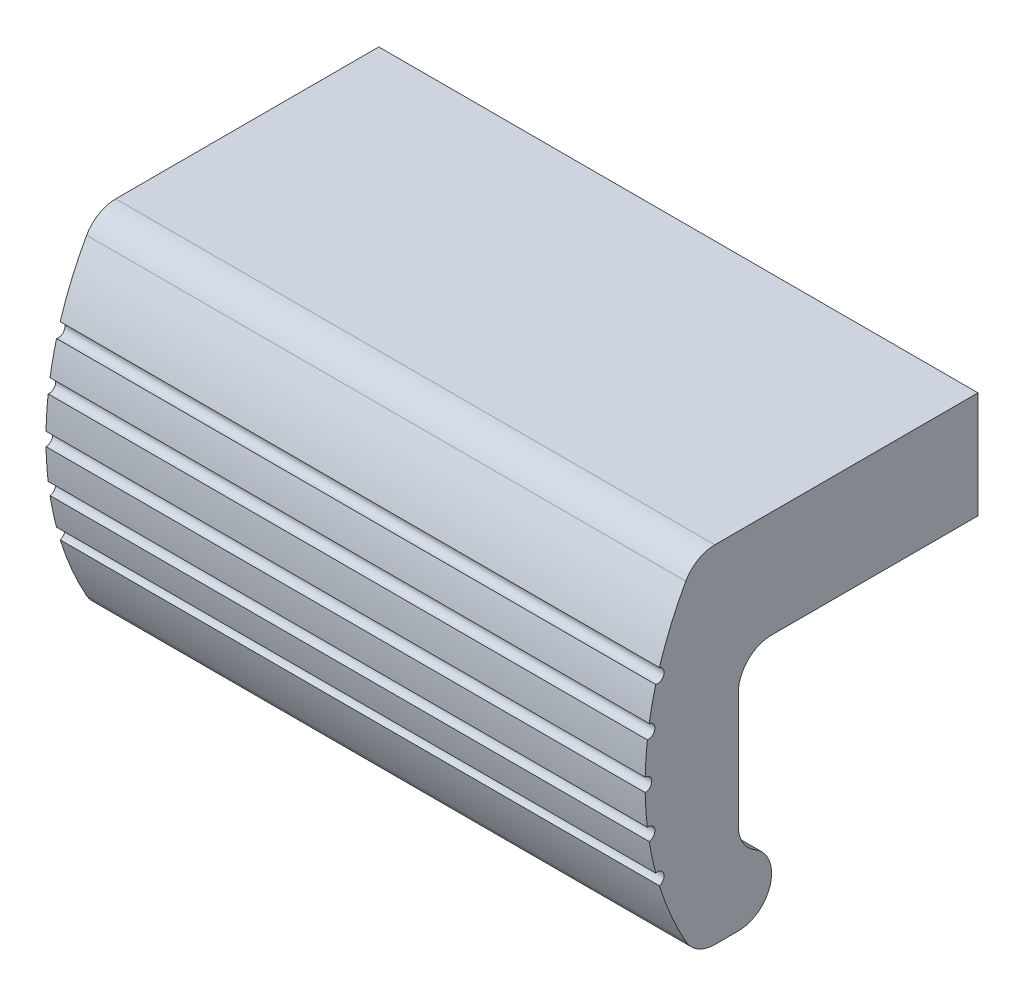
ISO-10303-21;
HEADER;
FILE_DESCRIPTION(('STEP AP214'),'2;1');
FILE_NAME('part.step','',(''),(''),'','','');
FILE_SCHEMA(('AUTOMOTIVE_DESIGN { 1 0 10303 214 1 1 1 1 }'));
ENDSEC;
DATA;
#1=APPLICATION_CONTEXT('core data for automotive mechanical design processes');
#2=APPLICATION_PROTOCOL_DEFINITION('international standard','automotive_design',2000,#1);
#3=PRODUCT_CONTEXT('',#1,'mechanical');
#4=PRODUCT('Part','Part','',(#3));
#5=PRODUCT_RELATED_PRODUCT_CATEGORY('part','',(#4));
#6=PRODUCT_DEFINITION_FORMATION('','',#4);
#7=PRODUCT_DEFINITION_CONTEXT('part definition',#1,'design');
#8=PRODUCT_DEFINITION('design','',#6,#7);
#9=PRODUCT_DEFINITION_SHAPE('','',#8);
#10=(LENGTH_UNIT() NAMED_UNIT(*) SI_UNIT(.MILLI.,.METRE.));
#11=(NAMED_UNIT(*) PLANE_ANGLE_UNIT() SI_UNIT($,.RADIAN.));
#12=(NAMED_UNIT(*) SI_UNIT($,.STERADIAN.) SOLID_ANGLE_UNIT());
#13=UNCERTAINTY_MEASURE_WITH_UNIT(LENGTH_MEASURE(1.E-05),#10,'distance_accuracy_value','');
#14=(GEOMETRIC_REPRESENTATION_CONTEXT(3) GLOBAL_UNCERTAINTY_ASSIGNED_CONTEXT((#13)) GLOBAL_UNIT_ASSIGNED_CONTEXT((#10,
#11,#12)) REPRESENTATION_CONTEXT('',''));
#15=CARTESIAN_POINT('',(0.,0.,0.));
#16=DIRECTION('',(0.,0.,1.));
#17=DIRECTION('',(1.,0.,0.));
#18=AXIS2_PLACEMENT_3D('',#15,#16,#17);
#19=CARTESIAN_POINT('',(-7.5,-4.,0.));
#20=DIRECTION('',(0.,1.,0.));
#21=DIRECTION('',(-1.,0.,0.));
#22=AXIS2_PLACEMENT_3D('',#19,#20,#21);
#23=PLANE('',#22);
#24=DIRECTION('',(1.,0.,0.));
#25=VECTOR('',#24,1.);
#26=CARTESIAN_POINT('',(-7.5,-4.,15.5));
#27=LINE('',#26,#25);
#28=CARTESIAN_POINT('',(-7.5,-4.,15.5));
#29=VERTEX_POINT('',#28);
#30=CARTESIAN_POINT('',(37.5,-4.,15.5));
#31=VERTEX_POINT('',#30);
#32=EDGE_CURVE('E9',#29,#31,#27,.T.);
#33=ORIENTED_EDGE('',*,*,#32,.F.);
#34=DIRECTION('',(0.,0.,1.));
#35=VECTOR('',#34,1.);
#36=CARTESIAN_POINT('',(-7.5,-4.,0.));
#37=LINE('',#36,#35);
#38=CARTESIAN_POINT('',(-7.5,-4.,0.));
#39=VERTEX_POINT('',#38);
#40=EDGE_CURVE('E232',#39,#29,#37,.T.);
#41=ORIENTED_EDGE('',*,*,#40,.F.);
#42=DIRECTION('',(1.,0.,0.));
#43=VECTOR('',#42,1.);
#44=CARTESIAN_POINT('',(-7.5,-4.,0.));
#45=LINE('',#44,#43);
#46=CARTESIAN_POINT('',(37.5,-4.,0.));
#47=VERTEX_POINT('',#46);
#48=EDGE_CURVE('E29',#39,#47,#45,.T.);
#49=ORIENTED_EDGE('',*,*,#48,.T.);
#50=DIRECTION('',(0.,0.,1.));
#51=VECTOR('',#50,1.);
#52=CARTESIAN_POINT('',(37.5,-4.,0.));
#53=LINE('',#52,#51);
#54=EDGE_CURVE('E167',#47,#31,#53,.T.);
#55=ORIENTED_EDGE('',*,*,#54,.T.);
#56=EDGE_LOOP('',(#33,#41,#49,#55));
#57=FACE_BOUND('',#56,.T.);
#58=ADVANCED_FACE('F14',(#57),#23,.F.);
#59=CARTESIAN_POINT('',(-7.5,-6.5,15.5));
#60=DIRECTION('',(1.,0.,0.));
#61=DIRECTION('',(0.,0.,-1.));
#62=AXIS2_PLACEMENT_3D('',#59,#60,#61);
#63=CYLINDRICAL_SURFACE('',#62,2.5);
#64=DIRECTION('',(1.,0.,0.));
#65=VECTOR('',#64,1.);
#66=CARTESIAN_POINT('',(-7.5,-6.5,18.));
#67=LINE('',#66,#65);
#68=CARTESIAN_POINT('',(-7.5,-6.5,18.));
#69=VERTEX_POINT('',#68);
#70=CARTESIAN_POINT('',(37.5,-6.5,18.));
#71=VERTEX_POINT('',#70);
#72=EDGE_CURVE('E22',#69,#71,#67,.T.);
#73=ORIENTED_EDGE('',*,*,#72,.F.);
#74=CARTESIAN_POINT('',(-7.5,-6.5,15.5));
#75=DIRECTION('',(-1.,0.,0.));
#76=DIRECTION('',(0.,0.,1.));
#77=AXIS2_PLACEMENT_3D('',#74,#75,#76);
#78=CIRCLE('',#77,2.5);
#79=EDGE_CURVE('E163',#69,#29,#78,.T.);
#80=ORIENTED_EDGE('',*,*,#79,.T.);
#81=ORIENTED_EDGE('',*,*,#32,.T.);
#82=CARTESIAN_POINT('',(37.5,-6.5,15.5));
#83=DIRECTION('',(-1.,0.,0.));
#84=DIRECTION('',(0.,0.,1.));
#85=AXIS2_PLACEMENT_3D('',#82,#83,#84);
#86=CIRCLE('',#85,2.5);
#87=EDGE_CURVE('E160',#71,#31,#86,.T.);
#88=ORIENTED_EDGE('',*,*,#87,.F.);
#89=EDGE_LOOP('',(#73,#80,#81,#88));
#90=FACE_BOUND('',#89,.T.);
#91=ADVANCED_FACE('F16',(#90),#63,.F.);
#92=CARTESIAN_POINT('',(-7.5,-6.5,18.));
#93=DIRECTION('',(0.,0.,1.));
#94=DIRECTION('',(1.,0.,0.));
#95=AXIS2_PLACEMENT_3D('',#92,#93,#94);
#96=PLANE('',#95);
#97=DIRECTION('',(1.,0.,0.));
#98=VECTOR('',#97,1.);
#99=CARTESIAN_POINT('',(-7.5,-15.1698729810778,18.));
#100=LINE('',#99,#98);
#101=CARTESIAN_POINT('',(-7.5,-15.1698729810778,18.));
#102=VERTEX_POINT('',#101);
#103=CARTESIAN_POINT('',(37.5,-15.1698729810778,18.));
#104=VERTEX_POINT('',#103);
#105=EDGE_CURVE('E324',#102,#104,#100,.T.);
#106=ORIENTED_EDGE('',*,*,#105,.F.);
#107=DIRECTION('',(0.,-1.,0.));
#108=VECTOR('',#107,1.);
#109=CARTESIAN_POINT('',(-7.5,-6.5,18.));
#110=LINE('',#109,#108);
#111=EDGE_CURVE('E235',#69,#102,#110,.T.);
#112=ORIENTED_EDGE('',*,*,#111,.F.);
#113=ORIENTED_EDGE('',*,*,#72,.T.);
#114=DIRECTION('',(0.,-1.,0.));
#115=VECTOR('',#114,1.);
#116=CARTESIAN_POINT('',(37.5,-6.5,18.));
#117=LINE('',#116,#115);
#118=EDGE_CURVE('E175',#71,#104,#117,.T.);
#119=ORIENTED_EDGE('',*,*,#118,.T.);
#120=EDGE_LOOP('',(#106,#112,#113,#119));
#121=FACE_BOUND('',#120,.T.);
#122=ADVANCED_FACE('F327',(#121),#96,.F.);
#123=CARTESIAN_POINT('',(-7.5,-15.1698729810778,15.5));
#124=DIRECTION('',(1.,0.,0.));
#125=DIRECTION('',(0.,0.,-1.));
#126=AXIS2_PLACEMENT_3D('',#123,#124,#125);
#127=CYLINDRICAL_SURFACE('',#126,2.5);
#128=DIRECTION('',(1.,0.,0.));
#129=VECTOR('',#128,1.);
#130=CARTESIAN_POINT('',(-7.5,-17.334936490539,16.75));
#131=LINE('',#130,#129);
#132=CARTESIAN_POINT('',(-7.5,-17.334936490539,16.75));
#133=VERTEX_POINT('',#132);
#134=CARTESIAN_POINT('',(37.5,-17.334936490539,16.75));
#135=VERTEX_POINT('',#134);
#136=EDGE_CURVE('E322',#133,#135,#131,.T.);
#137=ORIENTED_EDGE('',*,*,#136,.F.);
#138=CARTESIAN_POINT('',(-7.5,-15.1698729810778,15.5));
#139=DIRECTION('',(-1.,0.,0.));
#140=DIRECTION('',(0.,0.,1.));
#141=AXIS2_PLACEMENT_3D('',#138,#139,#140);
#142=CIRCLE('',#141,2.5);
#143=EDGE_CURVE('E238',#133,#102,#142,.T.);
#144=ORIENTED_EDGE('',*,*,#143,.T.);
#145=ORIENTED_EDGE('',*,*,#105,.T.);
#146=CARTESIAN_POINT('',(37.5,-15.1698729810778,15.5));
#147=DIRECTION('',(-1.,0.,0.));
#148=DIRECTION('',(0.,0.,1.));
#149=AXIS2_PLACEMENT_3D('',#146,#147,#148);
#150=CIRCLE('',#149,2.5);
#151=EDGE_CURVE('E177',#135,#104,#150,.T.);
#152=ORIENTED_EDGE('',*,*,#151,.F.);
#153=EDGE_LOOP('',(#137,#144,#145,#152));
#154=FACE_BOUND('',#153,.T.);
#155=ADVANCED_FACE('F396',(#154),#127,.F.);
#156=CARTESIAN_POINT('',(-7.5,-19.5,18.));
#157=DIRECTION('',(1.,0.,0.));
#158=DIRECTION('',(0.,0.,-1.));
#159=AXIS2_PLACEMENT_3D('',#156,#157,#158);
#160=CYLINDRICAL_SURFACE('',#159,2.5);
#161=DIRECTION('',(1.,0.,0.));
#162=VECTOR('',#161,1.);
#163=CARTESIAN_POINT('',(-7.5,-22.,18.));
#164=LINE('',#163,#162);
#165=CARTESIAN_POINT('',(-7.5,-22.,18.));
#166=VERTEX_POINT('',#165);
#167=CARTESIAN_POINT('',(37.5,-22.,18.));
#168=VERTEX_POINT('',#167);
#169=EDGE_CURVE('E320',#166,#168,#164,.T.);
#170=ORIENTED_EDGE('',*,*,#169,.F.);
#171=CARTESIAN_POINT('',(-7.5,-19.5,18.));
#172=DIRECTION('',(-1.,0.,0.));
#173=DIRECTION('',(0.,0.,1.));
#174=AXIS2_PLACEMENT_3D('',#171,#172,#173);
#175=CIRCLE('',#174,2.5);
#176=EDGE_CURVE('E241',#133,#166,#175,.T.);
#177=ORIENTED_EDGE('',*,*,#176,.F.);
#178=ORIENTED_EDGE('',*,*,#136,.T.);
#179=CARTESIAN_POINT('',(37.5,-19.5,18.));
#180=DIRECTION('',(-1.,0.,0.));
#181=DIRECTION('',(0.,0.,1.));
#182=AXIS2_PLACEMENT_3D('',#179,#180,#181);
#183=CIRCLE('',#182,2.5);
#184=EDGE_CURVE('E182',#135,#168,#183,.T.);
#185=ORIENTED_EDGE('',*,*,#184,.T.);
#186=EDGE_LOOP('',(#170,#177,#178,#185));
#187=FACE_BOUND('',#186,.T.);
#188=ADVANCED_FACE('F393',(#187),#160,.T.);
#189=CARTESIAN_POINT('',(-7.5,-22.,18.));
#190=DIRECTION('',(0.,1.,0.));
#191=DIRECTION('',(-1.,0.,0.));
#192=AXIS2_PLACEMENT_3D('',#189,#190,#191);
#193=PLANE('',#192);
#194=DIRECTION('',(1.,0.,0.));
#195=VECTOR('',#194,1.);
#196=CARTESIAN_POINT('',(-7.5,-22.,19.7616630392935));
#197=LINE('',#196,#195);
#198=CARTESIAN_POINT('',(-7.5,-22.,19.7616630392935));
#199=VERTEX_POINT('',#198);
#200=CARTESIAN_POINT('',(37.5,-22.,19.7616630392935));
#201=VERTEX_POINT('',#200);
#202=EDGE_CURVE('E318',#199,#201,#197,.T.);
#203=ORIENTED_EDGE('',*,*,#202,.F.);
#204=DIRECTION('',(0.,0.,1.));
#205=VECTOR('',#204,1.);
#206=CARTESIAN_POINT('',(-7.5,-22.,18.));
#207=LINE('',#206,#205);
#208=EDGE_CURVE('E244',#166,#199,#207,.T.);
#209=ORIENTED_EDGE('',*,*,#208,.F.);
#210=ORIENTED_EDGE('',*,*,#169,.T.);
#211=DIRECTION('',(0.,0.,1.));
#212=VECTOR('',#211,1.);
#213=CARTESIAN_POINT('',(37.5,-22.,18.));
#214=LINE('',#213,#212);
#215=EDGE_CURVE('E185',#168,#201,#214,.T.);
#216=ORIENTED_EDGE('',*,*,#215,.T.);
#217=EDGE_LOOP('',(#203,#209,#210,#216));
#218=FACE_BOUND('',#217,.T.);
#219=ADVANCED_FACE('F390',(#218),#193,.F.);
#220=CARTESIAN_POINT('',(-7.5,-19.5,19.7616630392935));
#221=DIRECTION('',(1.,0.,0.));
#222=DIRECTION('',(0.,0.,-1.));
#223=AXIS2_PLACEMENT_3D('',#220,#221,#222);
#224=CYLINDRICAL_SURFACE('',#223,2.5);
#225=DIRECTION('',(1.,0.,0.));
#226=VECTOR('',#225,1.);
#227=CARTESIAN_POINT('',(-7.5,-20.720930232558,21.943251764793));
#228=LINE('',#227,#226);
#229=CARTESIAN_POINT('',(-7.5,-20.720930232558,21.943251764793));
#230=VERTEX_POINT('',#229);
#231=CARTESIAN_POINT('',(37.5,-20.720930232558,21.943251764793));
#232=VERTEX_POINT('',#231);
#233=EDGE_CURVE('E316',#230,#232,#228,.T.);
#234=ORIENTED_EDGE('',*,*,#233,.F.);
#235=CARTESIAN_POINT('',(-7.5,-19.5,19.7616630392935));
#236=DIRECTION('',(-1.,0.,0.));
#237=DIRECTION('',(0.,0.,1.));
#238=AXIS2_PLACEMENT_3D('',#235,#236,#237);
#239=CIRCLE('',#238,2.5);
#240=EDGE_CURVE('E247',#199,#230,#239,.T.);
#241=ORIENTED_EDGE('',*,*,#240,.F.);
#242=ORIENTED_EDGE('',*,*,#202,.T.);
#243=CARTESIAN_POINT('',(37.5,-19.5,19.7616630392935));
#244=DIRECTION('',(-1.,0.,0.));
#245=DIRECTION('',(0.,0.,1.));
#246=AXIS2_PLACEMENT_3D('',#243,#244,#245);
#247=CIRCLE('',#246,2.5);
#248=EDGE_CURVE('E188',#201,#232,#247,.T.);
#249=ORIENTED_EDGE('',*,*,#248,.T.);
#250=EDGE_LOOP('',(#234,#241,#242,#249));
#251=FACE_BOUND('',#250,.T.);
#252=ADVANCED_FACE('F386',(#251),#224,.T.);
#253=CARTESIAN_POINT('',(-7.5,-9.,1.));
#254=DIRECTION('',(1.,0.,0.));
#255=DIRECTION('',(0.,0.,-1.));
#256=AXIS2_PLACEMENT_3D('',#253,#254,#255);
#257=CYLINDRICAL_SURFACE('',#256,24.);
#258=DIRECTION('',(1.,0.,0.));
#259=VECTOR('',#258,1.);
#260=CARTESIAN_POINT('',(-7.5,-16.094465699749,23.9274629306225));
#261=LINE('',#260,#259);
#262=CARTESIAN_POINT('',(-7.5,-16.094465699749,23.9274629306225));
#263=VERTEX_POINT('',#262);
#264=CARTESIAN_POINT('',(37.5,-16.094465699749,23.9274629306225));
#265=VERTEX_POINT('',#264);
#266=EDGE_CURVE('E314',#263,#265,#261,.T.);
#267=ORIENTED_EDGE('',*,*,#266,.F.);
#268=CARTESIAN_POINT('',(-7.5,-9.,1.));
#269=DIRECTION('',(-1.,0.,0.));
#270=DIRECTION('',(0.,0.,1.));
#271=AXIS2_PLACEMENT_3D('',#268,#269,#270);
#272=CIRCLE('',#271,24.);
#273=EDGE_CURVE('E250',#230,#263,#272,.T.);
#274=ORIENTED_EDGE('',*,*,#273,.F.);
#275=ORIENTED_EDGE('',*,*,#233,.T.);
#276=CARTESIAN_POINT('',(37.5,-9.,1.));
#277=DIRECTION('',(-1.,0.,0.));
#278=DIRECTION('',(0.,0.,1.));
#279=AXIS2_PLACEMENT_3D('',#276,#277,#278);
#280=CIRCLE('',#279,24.);
#281=EDGE_CURVE('E191',#232,#265,#280,.T.);
#282=ORIENTED_EDGE('',*,*,#281,.T.);
#283=EDGE_LOOP('',(#267,#274,#275,#282));
#284=FACE_BOUND('',#283,.T.);
#285=ADVANCED_FACE('F381',(#284),#257,.T.);
#286=CARTESIAN_POINT('',(-7.5,-15.615296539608,24.0702807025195));
#287=DIRECTION('',(1.,0.,0.));
#288=DIRECTION('',(0.,0.,-1.));
#289=AXIS2_PLACEMENT_3D('',#286,#287,#288);
#290=CYLINDRICAL_SURFACE('',#289,0.5);
#291=DIRECTION('',(1.,0.,0.));
#292=VECTOR('',#291,1.);
#293=CARTESIAN_POINT('',(-7.5,-15.1332561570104,24.2030853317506));
#294=LINE('',#293,#292);
#295=CARTESIAN_POINT('',(-7.5,-15.1332561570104,24.2030853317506));
#296=VERTEX_POINT('',#295);
#297=CARTESIAN_POINT('',(37.5,-15.1332561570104,24.2030853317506));
#298=VERTEX_POINT('',#297);
#299=EDGE_CURVE('E312',#296,#298,#294,.T.);
#300=ORIENTED_EDGE('',*,*,#299,.F.);
#301=CARTESIAN_POINT('',(-7.5,-15.615296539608,24.0702807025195));
#302=DIRECTION('',(-1.,0.,0.));
#303=DIRECTION('',(0.,0.,1.));
#304=AXIS2_PLACEMENT_3D('',#301,#302,#303);
#305=CIRCLE('',#304,0.5);
#306=EDGE_CURVE('E253',#296,#263,#305,.T.);
#307=ORIENTED_EDGE('',*,*,#306,.T.);
#308=ORIENTED_EDGE('',*,*,#266,.T.);
#309=CARTESIAN_POINT('',(37.5,-15.615296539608,24.0702807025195));
#310=DIRECTION('',(-1.,0.,0.));
#311=DIRECTION('',(0.,0.,1.));
#312=AXIS2_PLACEMENT_3D('',#309,#310,#311);
#313=CIRCLE('',#312,0.5);
#314=EDGE_CURVE('E194',#298,#265,#313,.T.);
#315=ORIENTED_EDGE('',*,*,#314,.F.);
#316=EDGE_LOOP('',(#300,#307,#308,#315));
#317=FACE_BOUND('',#316,.T.);
#318=ADVANCED_FACE('F378',(#317),#290,.F.);
#319=CARTESIAN_POINT('',(-7.5,-9.,1.));
#320=DIRECTION('',(1.,0.,0.));
#321=DIRECTION('',(0.,0.,-1.));
#322=AXIS2_PLACEMENT_3D('',#319,#320,#321);
#323=CYLINDRICAL_SURFACE('',#322,24.);
#324=DIRECTION('',(1.,0.,0.));
#325=VECTOR('',#324,1.);
#326=CARTESIAN_POINT('',(-7.5,-12.8345367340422,24.6916932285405));
#327=LINE('',#326,#325);
#328=CARTESIAN_POINT('',(-7.5,-12.8345367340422,24.6916932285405));
#329=VERTEX_POINT('',#328);
#330=CARTESIAN_POINT('',(37.5,-12.8345367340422,24.6916932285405));
#331=VERTEX_POINT('',#330);
#332=EDGE_CURVE('E310',#329,#331,#327,.T.);
#333=ORIENTED_EDGE('',*,*,#332,.F.);
#334=CARTESIAN_POINT('',(-7.5,-9.,1.));
#335=DIRECTION('',(-1.,0.,0.));
#336=DIRECTION('',(0.,0.,1.));
#337=AXIS2_PLACEMENT_3D('',#334,#335,#336);
#338=CIRCLE('',#337,24.);
#339=EDGE_CURVE('E256',#296,#329,#338,.T.);
#340=ORIENTED_EDGE('',*,*,#339,.F.);
#341=ORIENTED_EDGE('',*,*,#299,.T.);
#342=CARTESIAN_POINT('',(37.5,-9.,1.));
#343=DIRECTION('',(-1.,0.,0.));
#344=DIRECTION('',(0.,0.,1.));
#345=AXIS2_PLACEMENT_3D('',#342,#343,#344);
#346=CIRCLE('',#345,24.);
#347=EDGE_CURVE('E197',#298,#331,#346,.T.);
#348=ORIENTED_EDGE('',*,*,#347,.T.);
#349=EDGE_LOOP('',(#333,#340,#341,#348));
#350=FACE_BOUND('',#349,.T.);
#351=ADVANCED_FACE('F374',(#350),#323,.T.);
#352=CARTESIAN_POINT('',(-7.5,-12.3401544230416,24.7664336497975));
#353=DIRECTION('',(1.,0.,0.));
#354=DIRECTION('',(0.,0.,-1.));
#355=AXIS2_PLACEMENT_3D('',#352,#353,#354);
#356=CYLINDRICAL_SURFACE('',#355,0.5);
#357=DIRECTION('',(1.,0.,0.));
#358=VECTOR('',#357,1.);
#359=CARTESIAN_POINT('',(-7.5,-11.8443223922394,24.830858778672));
#360=LINE('',#359,#358);
#361=CARTESIAN_POINT('',(-7.5,-11.8443223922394,24.830858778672));
#362=VERTEX_POINT('',#361);
#363=CARTESIAN_POINT('',(37.5,-11.8443223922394,24.830858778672));
#364=VERTEX_POINT('',#363);
#365=EDGE_CURVE('E308',#362,#364,#360,.T.);
#366=ORIENTED_EDGE('',*,*,#365,.F.);
#367=CARTESIAN_POINT('',(-7.5,-12.3401544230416,24.7664336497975));
#368=DIRECTION('',(-1.,0.,0.));
#369=DIRECTION('',(0.,0.,1.));
#370=AXIS2_PLACEMENT_3D('',#367,#368,#369);
#371=CIRCLE('',#370,0.5);
#372=EDGE_CURVE('E259',#362,#329,#371,.T.);
#373=ORIENTED_EDGE('',*,*,#372,.T.);
#374=ORIENTED_EDGE('',*,*,#332,.T.);
#375=CARTESIAN_POINT('',(37.5,-12.3401544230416,24.7664336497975));
#376=DIRECTION('',(-1.,0.,0.));
#377=DIRECTION('',(0.,0.,1.));
#378=AXIS2_PLACEMENT_3D('',#375,#376,#377);
#379=CIRCLE('',#378,0.5);
#380=EDGE_CURVE('E200',#364,#331,#379,.T.);
#381=ORIENTED_EDGE('',*,*,#380,.F.);
#382=EDGE_LOOP('',(#366,#373,#374,#381));
#383=FACE_BOUND('',#382,.T.);
#384=ADVANCED_FACE('F369',(#383),#356,.F.);
#385=CARTESIAN_POINT('',(-7.5,-9.,1.));
#386=DIRECTION('',(1.,0.,0.));
#387=DIRECTION('',(0.,0.,-1.));
#388=AXIS2_PLACEMENT_3D('',#385,#386,#387);
#389=CYLINDRICAL_SURFACE('',#388,24.);
#390=DIRECTION('',(1.,0.,0.));
#391=VECTOR('',#390,1.);
#392=CARTESIAN_POINT('',(-7.5,-9.49997287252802,24.9947916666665));
#393=LINE('',#392,#391);
#394=CARTESIAN_POINT('',(-7.5,-9.49997287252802,24.9947916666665));
#395=VERTEX_POINT('',#394);
#396=CARTESIAN_POINT('',(37.5,-9.49997287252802,24.9947916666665));
#397=VERTEX_POINT('',#396);
#398=EDGE_CURVE('E306',#395,#397,#393,.T.);
#399=ORIENTED_EDGE('',*,*,#398,.F.);
#400=CARTESIAN_POINT('',(-7.5,-9.,1.));
#401=DIRECTION('',(-1.,0.,0.));
#402=DIRECTION('',(0.,0.,1.));
#403=AXIS2_PLACEMENT_3D('',#400,#401,#402);
#404=CIRCLE('',#403,24.);
#405=EDGE_CURVE('E262',#362,#395,#404,.T.);
#406=ORIENTED_EDGE('',*,*,#405,.F.);
#407=ORIENTED_EDGE('',*,*,#365,.T.);
#408=CARTESIAN_POINT('',(37.5,-9.,1.));
#409=DIRECTION('',(-1.,0.,0.));
#410=DIRECTION('',(0.,0.,1.));
#411=AXIS2_PLACEMENT_3D('',#408,#409,#410);
#412=CIRCLE('',#411,24.);
#413=EDGE_CURVE('E203',#364,#397,#412,.T.);
#414=ORIENTED_EDGE('',*,*,#413,.T.);
#415=EDGE_LOOP('',(#399,#406,#407,#414));
#416=FACE_BOUND('',#415,.T.);
#417=ADVANCED_FACE('F365',(#416),#389,.T.);
#418=CARTESIAN_POINT('',(-7.5,-9.,25.));
#419=DIRECTION('',(1.,0.,0.));
#420=DIRECTION('',(0.,0.,-1.));
#421=AXIS2_PLACEMENT_3D('',#418,#419,#420);
#422=CYLINDRICAL_SURFACE('',#421,0.500000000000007);
#423=DIRECTION('',(1.,0.,0.));
#424=VECTOR('',#423,1.);
#425=CARTESIAN_POINT('',(-7.5,-8.50002712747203,24.9947916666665));
#426=LINE('',#425,#424);
#427=CARTESIAN_POINT('',(-7.5,-8.50002712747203,24.9947916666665));
#428=VERTEX_POINT('',#427);
#429=CARTESIAN_POINT('',(37.5,-8.50002712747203,24.9947916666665));
#430=VERTEX_POINT('',#429);
#431=EDGE_CURVE('E304',#428,#430,#426,.T.);
#432=ORIENTED_EDGE('',*,*,#431,.F.);
#433=CARTESIAN_POINT('',(-7.5,-9.,25.));
#434=DIRECTION('',(-1.,0.,0.));
#435=DIRECTION('',(0.,0.,1.));
#436=AXIS2_PLACEMENT_3D('',#433,#434,#435);
#437=CIRCLE('',#436,0.500000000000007);
#438=EDGE_CURVE('E265',#428,#395,#437,.T.);
#439=ORIENTED_EDGE('',*,*,#438,.T.);
#440=ORIENTED_EDGE('',*,*,#398,.T.);
#441=CARTESIAN_POINT('',(37.5,-9.,25.));
#442=DIRECTION('',(-1.,0.,0.));
#443=DIRECTION('',(0.,0.,1.));
#444=AXIS2_PLACEMENT_3D('',#441,#442,#443);
#445=CIRCLE('',#444,0.500000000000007);
#446=EDGE_CURVE('E206',#430,#397,#445,.T.);
#447=ORIENTED_EDGE('',*,*,#446,.F.);
#448=EDGE_LOOP('',(#432,#439,#440,#447));
#449=FACE_BOUND('',#448,.T.);
#450=ADVANCED_FACE('F361',(#449),#422,.F.);
#451=CARTESIAN_POINT('',(-7.5,-9.,1.));
#452=DIRECTION('',(1.,0.,0.));
#453=DIRECTION('',(0.,0.,-1.));
#454=AXIS2_PLACEMENT_3D('',#451,#452,#453);
#455=CYLINDRICAL_SURFACE('',#454,24.);
#456=DIRECTION('',(1.,0.,0.));
#457=VECTOR('',#456,1.);
#458=CARTESIAN_POINT('',(-7.5,-6.15567760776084,24.830858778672));
#459=LINE('',#458,#457);
#460=CARTESIAN_POINT('',(-7.5,-6.15567760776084,24.830858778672));
#461=VERTEX_POINT('',#460);
#462=CARTESIAN_POINT('',(37.5,-6.15567760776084,24.830858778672));
#463=VERTEX_POINT('',#462);
#464=EDGE_CURVE('E302',#461,#463,#459,.T.);
#465=ORIENTED_EDGE('',*,*,#464,.F.);
#466=CARTESIAN_POINT('',(-7.5,-9.,1.));
#467=DIRECTION('',(-1.,0.,0.));
#468=DIRECTION('',(0.,0.,1.));
#469=AXIS2_PLACEMENT_3D('',#466,#467,#468);
#470=CIRCLE('',#469,24.);
#471=EDGE_CURVE('E268',#428,#461,#470,.T.);
#472=ORIENTED_EDGE('',*,*,#471,.F.);
#473=ORIENTED_EDGE('',*,*,#431,.T.);
#474=CARTESIAN_POINT('',(37.5,-9.,1.));
#475=DIRECTION('',(-1.,0.,0.));
#476=DIRECTION('',(0.,0.,1.));
#477=AXIS2_PLACEMENT_3D('',#474,#475,#476);
#478=CIRCLE('',#477,24.);
#479=EDGE_CURVE('E209',#430,#463,#478,.T.);
#480=ORIENTED_EDGE('',*,*,#479,.T.);
#481=EDGE_LOOP('',(#465,#472,#473,#480));
#482=FACE_BOUND('',#481,.T.);
#483=ADVANCED_FACE('F357',(#482),#455,.T.);
#484=CARTESIAN_POINT('',(-7.5,-5.65984557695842,24.7664336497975));
#485=DIRECTION('',(1.,0.,0.));
#486=DIRECTION('',(0.,0.,-1.));
#487=AXIS2_PLACEMENT_3D('',#484,#485,#486);
#488=CYLINDRICAL_SURFACE('',#487,0.499999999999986);
#489=DIRECTION('',(1.,0.,0.));
#490=VECTOR('',#489,1.);
#491=CARTESIAN_POINT('',(-7.5,-5.16546326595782,24.6916932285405));
#492=LINE('',#491,#490);
#493=CARTESIAN_POINT('',(-7.5,-5.16546326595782,24.6916932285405));
#494=VERTEX_POINT('',#493);
#495=CARTESIAN_POINT('',(37.5,-5.16546326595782,24.6916932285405));
#496=VERTEX_POINT('',#495);
#497=EDGE_CURVE('E300',#494,#496,#492,.T.);
#498=ORIENTED_EDGE('',*,*,#497,.F.);
#499=CARTESIAN_POINT('',(-7.5,-5.65984557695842,24.7664336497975));
#500=DIRECTION('',(-1.,0.,0.));
#501=DIRECTION('',(0.,0.,1.));
#502=AXIS2_PLACEMENT_3D('',#499,#500,#501);
#503=CIRCLE('',#502,0.499999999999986);
#504=EDGE_CURVE('E271',#494,#461,#503,.T.);
#505=ORIENTED_EDGE('',*,*,#504,.T.);
#506=ORIENTED_EDGE('',*,*,#464,.T.);
#507=CARTESIAN_POINT('',(37.5,-5.65984557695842,24.7664336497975));
#508=DIRECTION('',(-1.,0.,0.));
#509=DIRECTION('',(0.,0.,1.));
#510=AXIS2_PLACEMENT_3D('',#507,#508,#509);
#511=CIRCLE('',#510,0.499999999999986);
#512=EDGE_CURVE('E212',#496,#463,#511,.T.);
#513=ORIENTED_EDGE('',*,*,#512,.F.);
#514=EDGE_LOOP('',(#498,#505,#506,#513));
#515=FACE_BOUND('',#514,.T.);
#516=ADVANCED_FACE('F354',(#515),#488,.F.);
#517=CARTESIAN_POINT('',(-7.5,-9.,1.));
#518=DIRECTION('',(1.,0.,0.));
#519=DIRECTION('',(0.,0.,-1.));
#520=AXIS2_PLACEMENT_3D('',#517,#518,#519);
#521=CYLINDRICAL_SURFACE('',#520,24.);
#522=DIRECTION('',(1.,0.,0.));
#523=VECTOR('',#522,1.);
#524=CARTESIAN_POINT('',(-7.5,-2.8667438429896,24.2030853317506));
#525=LINE('',#524,#523);
#526=CARTESIAN_POINT('',(-7.5,-2.8667438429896,24.2030853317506));
#527=VERTEX_POINT('',#526);
#528=CARTESIAN_POINT('',(37.5,-2.8667438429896,24.2030853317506));
#529=VERTEX_POINT('',#528);
#530=EDGE_CURVE('E298',#527,#529,#525,.T.);
#531=ORIENTED_EDGE('',*,*,#530,.F.);
#532=CARTESIAN_POINT('',(-7.5,-9.,1.));
#533=DIRECTION('',(-1.,0.,0.));
#534=DIRECTION('',(0.,0.,1.));
#535=AXIS2_PLACEMENT_3D('',#532,#533,#534);
#536=CIRCLE('',#535,24.);
#537=EDGE_CURVE('E274',#494,#527,#536,.T.);
#538=ORIENTED_EDGE('',*,*,#537,.F.);
#539=ORIENTED_EDGE('',*,*,#497,.T.);
#540=CARTESIAN_POINT('',(37.5,-9.,1.));
#541=DIRECTION('',(-1.,0.,0.));
#542=DIRECTION('',(0.,0.,1.));
#543=AXIS2_PLACEMENT_3D('',#540,#541,#542);
#544=CIRCLE('',#543,24.);
#545=EDGE_CURVE('E215',#496,#529,#544,.T.);
#546=ORIENTED_EDGE('',*,*,#545,.T.);
#547=EDGE_LOOP('',(#531,#538,#539,#546));
#548=FACE_BOUND('',#547,.T.);
#549=ADVANCED_FACE('F350',(#548),#521,.T.);
#550=CARTESIAN_POINT('',(-7.5,-2.38470346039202,24.0702807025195));
#551=DIRECTION('',(1.,0.,0.));
#552=DIRECTION('',(0.,0.,-1.));
#553=AXIS2_PLACEMENT_3D('',#550,#551,#552);
#554=CYLINDRICAL_SURFACE('',#553,0.500000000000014);
#555=DIRECTION('',(1.,0.,0.));
#556=VECTOR('',#555,1.);
#557=CARTESIAN_POINT('',(-7.5,-1.90553430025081,23.9274629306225));
#558=LINE('',#557,#556);
#559=CARTESIAN_POINT('',(-7.5,-1.90553430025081,23.9274629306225));
#560=VERTEX_POINT('',#559);
#561=CARTESIAN_POINT('',(37.5,-1.90553430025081,23.9274629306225));
#562=VERTEX_POINT('',#561);
#563=EDGE_CURVE('E296',#560,#562,#558,.T.);
#564=ORIENTED_EDGE('',*,*,#563,.F.);
#565=CARTESIAN_POINT('',(-7.5,-2.38470346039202,24.0702807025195));
#566=DIRECTION('',(-1.,0.,0.));
#567=DIRECTION('',(0.,0.,1.));
#568=AXIS2_PLACEMENT_3D('',#565,#566,#567);
#569=CIRCLE('',#568,0.500000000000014);
#570=EDGE_CURVE('E277',#560,#527,#569,.T.);
#571=ORIENTED_EDGE('',*,*,#570,.T.);
#572=ORIENTED_EDGE('',*,*,#530,.T.);
#573=CARTESIAN_POINT('',(37.5,-2.38470346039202,24.0702807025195));
#574=DIRECTION('',(-1.,0.,0.));
#575=DIRECTION('',(0.,0.,1.));
#576=AXIS2_PLACEMENT_3D('',#573,#574,#575);
#577=CIRCLE('',#576,0.500000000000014);
#578=EDGE_CURVE('E218',#562,#529,#577,.T.);
#579=ORIENTED_EDGE('',*,*,#578,.F.);
#580=EDGE_LOOP('',(#564,#571,#572,#579));
#581=FACE_BOUND('',#580,.T.);
#582=ADVANCED_FACE('F345',(#581),#554,.F.);
#583=CARTESIAN_POINT('',(-7.5,-9.,1.));
#584=DIRECTION('',(1.,0.,0.));
#585=DIRECTION('',(0.,0.,-1.));
#586=AXIS2_PLACEMENT_3D('',#583,#584,#585);
#587=CYLINDRICAL_SURFACE('',#586,24.);
#588=DIRECTION('',(1.,0.,0.));
#589=VECTOR('',#588,1.);
#590=CARTESIAN_POINT('',(-7.5,2.72093023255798,21.943251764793));
#591=LINE('',#590,#589);
#592=CARTESIAN_POINT('',(-7.5,2.72093023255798,21.943251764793));
#593=VERTEX_POINT('',#592);
#594=CARTESIAN_POINT('',(37.5,2.72093023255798,21.943251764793));
#595=VERTEX_POINT('',#594);
#596=EDGE_CURVE('E294',#593,#595,#591,.T.);
#597=ORIENTED_EDGE('',*,*,#596,.F.);
#598=CARTESIAN_POINT('',(-7.5,-9.,1.));
#599=DIRECTION('',(-1.,0.,0.));
#600=DIRECTION('',(0.,0.,1.));
#601=AXIS2_PLACEMENT_3D('',#598,#599,#600);
#602=CIRCLE('',#601,24.);
#603=EDGE_CURVE('E280',#560,#593,#602,.T.);
#604=ORIENTED_EDGE('',*,*,#603,.F.);
#605=ORIENTED_EDGE('',*,*,#563,.T.);
#606=CARTESIAN_POINT('',(37.5,-9.,1.));
#607=DIRECTION('',(-1.,0.,0.));
#608=DIRECTION('',(0.,0.,1.));
#609=AXIS2_PLACEMENT_3D('',#606,#607,#608);
#610=CIRCLE('',#609,24.);
#611=EDGE_CURVE('E221',#562,#595,#610,.T.);
#612=ORIENTED_EDGE('',*,*,#611,.T.);
#613=EDGE_LOOP('',(#597,#604,#605,#612));
#614=FACE_BOUND('',#613,.T.);
#615=ADVANCED_FACE('F341',(#614),#587,.T.);
#616=CARTESIAN_POINT('',(-7.5,1.5,19.7616630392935));
#617=DIRECTION('',(1.,0.,0.));
#618=DIRECTION('',(0.,0.,-1.));
#619=AXIS2_PLACEMENT_3D('',#616,#617,#618);
#620=CYLINDRICAL_SURFACE('',#619,2.5);
#621=DIRECTION('',(1.,0.,0.));
#622=VECTOR('',#621,1.);
#623=CARTESIAN_POINT('',(-7.5,4.,19.7616630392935));
#624=LINE('',#623,#622);
#625=CARTESIAN_POINT('',(-7.5,4.,19.7616630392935));
#626=VERTEX_POINT('',#625);
#627=CARTESIAN_POINT('',(37.5,4.,19.7616630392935));
#628=VERTEX_POINT('',#627);
#629=EDGE_CURVE('E292',#626,#628,#624,.T.);
#630=ORIENTED_EDGE('',*,*,#629,.F.);
#631=CARTESIAN_POINT('',(-7.5,1.5,19.7616630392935));
#632=DIRECTION('',(-1.,0.,0.));
#633=DIRECTION('',(0.,0.,1.));
#634=AXIS2_PLACEMENT_3D('',#631,#632,#633);
#635=CIRCLE('',#634,2.5);
#636=EDGE_CURVE('E283',#593,#626,#635,.T.);
#637=ORIENTED_EDGE('',*,*,#636,.F.);
#638=ORIENTED_EDGE('',*,*,#596,.T.);
#639=CARTESIAN_POINT('',(37.5,1.5,19.7616630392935));
#640=DIRECTION('',(-1.,0.,0.));
#641=DIRECTION('',(0.,0.,1.));
#642=AXIS2_PLACEMENT_3D('',#639,#640,#641);
#643=CIRCLE('',#642,2.5);
#644=EDGE_CURVE('E224',#595,#628,#643,.T.);
#645=ORIENTED_EDGE('',*,*,#644,.T.);
#646=EDGE_LOOP('',(#630,#637,#638,#645));
#647=FACE_BOUND('',#646,.T.);
#648=ADVANCED_FACE('F337',(#647),#620,.T.);
#649=CARTESIAN_POINT('',(-7.5,4.,0.));
#650=DIRECTION('',(0.,1.,0.));
#651=DIRECTION('',(-1.,0.,0.));
#652=AXIS2_PLACEMENT_3D('',#649,#650,#651);
#653=PLANE('',#652);
#654=DIRECTION('',(1.,0.,0.));
#655=VECTOR('',#654,1.);
#656=CARTESIAN_POINT('',(-7.5,4.,0.));
#657=LINE('',#656,#655);
#658=CARTESIAN_POINT('',(-7.5,4.,0.));
#659=VERTEX_POINT('',#658);
#660=CARTESIAN_POINT('',(37.5,4.,0.));
#661=VERTEX_POINT('',#660);
#662=EDGE_CURVE('E37',#659,#661,#657,.T.);
#663=ORIENTED_EDGE('',*,*,#662,.F.);
#664=DIRECTION('',(0.,0.,1.));
#665=VECTOR('',#664,1.);
#666=CARTESIAN_POINT('',(-7.5,4.,0.));
#667=LINE('',#666,#665);
#668=EDGE_CURVE('E286',#659,#626,#667,.T.);
#669=ORIENTED_EDGE('',*,*,#668,.T.);
#670=ORIENTED_EDGE('',*,*,#629,.T.);
#671=DIRECTION('',(0.,0.,1.));
#672=VECTOR('',#671,1.);
#673=CARTESIAN_POINT('',(37.5,4.,0.));
#674=LINE('',#673,#672);
#675=EDGE_CURVE('E227',#661,#628,#674,.T.);
#676=ORIENTED_EDGE('',*,*,#675,.F.);
#677=EDGE_LOOP('',(#663,#669,#670,#676));
#678=FACE_BOUND('',#677,.T.);
#679=ADVANCED_FACE('F333',(#678),#653,.T.);
#680=CARTESIAN_POINT('',(-7.5,-4.,0.));
#681=DIRECTION('',(0.,0.,-1.));
#682=DIRECTION('',(-1.,0.,0.));
#683=AXIS2_PLACEMENT_3D('',#680,#681,#682);
#684=PLANE('',#683);
#685=CARTESIAN_POINT('',(0.,0.,0.));
#686=DIRECTION('',(0.,0.,-1.));
#687=DIRECTION('',(-1.,0.,0.));
#688=AXIS2_PLACEMENT_3D('',#685,#686,#687);
#689=CIRCLE('',#688,2.);
#690=CARTESIAN_POINT('',(-2.,0.,0.));
#691=VERTEX_POINT('',#690);
#692=EDGE_CURVE('E632',#691,#691,#689,.T.);
#693=ORIENTED_EDGE('',*,*,#692,.F.);
#694=EDGE_LOOP('',(#693));
#695=FACE_BOUND('',#694,.T.);
#696=CARTESIAN_POINT('',(30.,0.,0.));
#697=DIRECTION('',(0.,0.,-1.));
#698=DIRECTION('',(-1.,0.,0.));
#699=AXIS2_PLACEMENT_3D('',#696,#697,#698);
#700=CIRCLE('',#699,2.);
#701=CARTESIAN_POINT('',(28.,0.,0.));
#702=VERTEX_POINT('',#701);
#703=EDGE_CURVE('E631',#702,#702,#700,.T.);
#704=ORIENTED_EDGE('',*,*,#703,.F.);
#705=EDGE_LOOP('',(#704));
#706=FACE_BOUND('',#705,.T.);
#707=DIRECTION('',(0.,1.,0.));
#708=VECTOR('',#707,1.);
#709=CARTESIAN_POINT('',(-7.5,-4.,0.));
#710=LINE('',#709,#708);
#711=EDGE_CURVE('E288',#39,#659,#710,.T.);
#712=ORIENTED_EDGE('',*,*,#711,.T.);
#713=ORIENTED_EDGE('',*,*,#662,.T.);
#714=DIRECTION('',(0.,1.,0.));
#715=VECTOR('',#714,1.);
#716=CARTESIAN_POINT('',(37.5,-4.,0.));
#717=LINE('',#716,#715);
#718=EDGE_CURVE('E230',#47,#661,#717,.T.);
#719=ORIENTED_EDGE('',*,*,#718,.F.);
#720=ORIENTED_EDGE('',*,*,#48,.F.);
#721=EDGE_LOOP('',(#712,#713,#719,#720));
#722=FACE_BOUND('',#721,.T.);
#723=ADVANCED_FACE('F332',(#695,#706,#722),#684,.T.);
#724=CARTESIAN_POINT('',(-7.5,-6.5,15.5));
#725=DIRECTION('',(-1.,0.,0.));
#726=DIRECTION('',(0.,0.,1.));
#727=AXIS2_PLACEMENT_3D('',#724,#725,#726);
#728=PLANE('',#727);
#729=ORIENTED_EDGE('',*,*,#40,.T.);
#730=ORIENTED_EDGE('',*,*,#79,.F.);
#731=ORIENTED_EDGE('',*,*,#111,.T.);
#732=ORIENTED_EDGE('',*,*,#143,.F.);
#733=ORIENTED_EDGE('',*,*,#176,.T.);
#734=ORIENTED_EDGE('',*,*,#208,.T.);
#735=ORIENTED_EDGE('',*,*,#240,.T.);
#736=ORIENTED_EDGE('',*,*,#273,.T.);
#737=ORIENTED_EDGE('',*,*,#306,.F.);
#738=ORIENTED_EDGE('',*,*,#339,.T.);
#739=ORIENTED_EDGE('',*,*,#372,.F.);
#740=ORIENTED_EDGE('',*,*,#405,.T.);
#741=ORIENTED_EDGE('',*,*,#438,.F.);
#742=ORIENTED_EDGE('',*,*,#471,.T.);
#743=ORIENTED_EDGE('',*,*,#504,.F.);
#744=ORIENTED_EDGE('',*,*,#537,.T.);
#745=ORIENTED_EDGE('',*,*,#570,.F.);
#746=ORIENTED_EDGE('',*,*,#603,.T.);
#747=ORIENTED_EDGE('',*,*,#636,.T.);
#748=ORIENTED_EDGE('',*,*,#668,.F.);
#749=ORIENTED_EDGE('',*,*,#711,.F.);
#750=EDGE_LOOP('',(#729,#730,#731,#732,#733,#734,#735,#736,#737,#738,#739,#740,#741,#742,#743,
#744,#745,#746,#747,#748,#749));
#751=FACE_BOUND('',#750,.T.);
#752=ADVANCED_FACE('F329',(#751),#728,.T.);
#753=CARTESIAN_POINT('',(37.5,-6.5,15.5));
#754=DIRECTION('',(-1.,0.,0.));
#755=DIRECTION('',(0.,0.,1.));
#756=AXIS2_PLACEMENT_3D('',#753,#754,#755);
#757=PLANE('',#756);
#758=ORIENTED_EDGE('',*,*,#54,.F.);
#759=ORIENTED_EDGE('',*,*,#718,.T.);
#760=ORIENTED_EDGE('',*,*,#675,.T.);
#761=ORIENTED_EDGE('',*,*,#644,.F.);
#762=ORIENTED_EDGE('',*,*,#611,.F.);
#763=ORIENTED_EDGE('',*,*,#578,.T.);
#764=ORIENTED_EDGE('',*,*,#545,.F.);
#765=ORIENTED_EDGE('',*,*,#512,.T.);
#766=ORIENTED_EDGE('',*,*,#479,.F.);
#767=ORIENTED_EDGE('',*,*,#446,.T.);
#768=ORIENTED_EDGE('',*,*,#413,.F.);
#769=ORIENTED_EDGE('',*,*,#380,.T.);
#770=ORIENTED_EDGE('',*,*,#347,.F.);
#771=ORIENTED_EDGE('',*,*,#314,.T.);
#772=ORIENTED_EDGE('',*,*,#281,.F.);
#773=ORIENTED_EDGE('',*,*,#248,.F.);
#774=ORIENTED_EDGE('',*,*,#215,.F.);
#775=ORIENTED_EDGE('',*,*,#184,.F.);
#776=ORIENTED_EDGE('',*,*,#151,.T.);
#777=ORIENTED_EDGE('',*,*,#118,.F.);
#778=ORIENTED_EDGE('',*,*,#87,.T.);
#779=EDGE_LOOP('',(#758,#759,#760,#761,#762,#763,#764,#765,#766,#767,#768,#769,#770,#771,#772,
#773,#774,#775,#776,#777,#778));
#780=FACE_BOUND('',#779,.T.);
#781=ADVANCED_FACE('F172',(#780),#757,.F.);
#782=CARTESIAN_POINT('',(30.,0.,8.));
#783=DIRECTION('',(0.,0.,-1.));
#784=DIRECTION('',(-1.,0.,0.));
#785=AXIS2_PLACEMENT_3D('',#782,#783,#784);
#786=CYLINDRICAL_SURFACE('',#785,2.);
#787=CARTESIAN_POINT('',(30.,0.,8.));
#788=DIRECTION('',(0.,0.,-1.));
#789=DIRECTION('',(-1.,0.,0.));
#790=AXIS2_PLACEMENT_3D('',#787,#788,#789);
#791=CIRCLE('',#790,2.);
#792=CARTESIAN_POINT('',(28.,0.,8.));
#793=VERTEX_POINT('',#792);
#794=EDGE_CURVE('E170',#793,#793,#791,.T.);
#795=ORIENTED_EDGE('',*,*,#794,.F.);
#796=EDGE_LOOP('',(#795));
#797=FACE_BOUND('',#796,.T.);
#798=ORIENTED_EDGE('',*,*,#703,.T.);
#799=EDGE_LOOP('',(#798));
#800=FACE_BOUND('',#799,.T.);
#801=ADVANCED_FACE('F545',(#797,#800),#786,.F.);
#802=CARTESIAN_POINT('',(30.,0.,8.));
#803=DIRECTION('',(0.,0.,-1.));
#804=DIRECTION('',(-1.,0.,0.));
#805=AXIS2_PLACEMENT_3D('',#802,#803,#804);
#806=PLANE('',#805);
#807=ORIENTED_EDGE('',*,*,#794,.T.);
#808=EDGE_LOOP('',(#807));
#809=FACE_BOUND('',#808,.T.);
#810=ADVANCED_FACE('F546',(#809),#806,.T.);
#811=CARTESIAN_POINT('',(0.,0.,8.));
#812=DIRECTION('',(0.,0.,-1.));
#813=DIRECTION('',(-1.,0.,0.));
#814=AXIS2_PLACEMENT_3D('',#811,#812,#813);
#815=CYLINDRICAL_SURFACE('',#814,2.);
#816=CARTESIAN_POINT('',(0.,0.,8.));
#817=DIRECTION('',(0.,0.,-1.));
#818=DIRECTION('',(-1.,0.,0.));
#819=AXIS2_PLACEMENT_3D('',#816,#817,#818);
#820=CIRCLE('',#819,2.);
#821=CARTESIAN_POINT('',(-2.,0.,8.));
#822=VERTEX_POINT('',#821);
#823=EDGE_CURVE('E630',#822,#822,#820,.T.);
#824=ORIENTED_EDGE('',*,*,#823,.F.);
#825=EDGE_LOOP('',(#824));
#826=FACE_BOUND('',#825,.T.);
#827=ORIENTED_EDGE('',*,*,#692,.T.);
#828=EDGE_LOOP('',(#827));
#829=FACE_BOUND('',#828,.T.);
#830=ADVANCED_FACE('F562',(#826,#829),#815,.F.);
#831=CARTESIAN_POINT('',(0.,0.,8.));
#832=DIRECTION('',(0.,0.,-1.));
#833=DIRECTION('',(-1.,0.,0.));
#834=AXIS2_PLACEMENT_3D('',#831,#832,#833);
#835=PLANE('',#834);
#836=ORIENTED_EDGE('',*,*,#823,.T.);
#837=EDGE_LOOP('',(#836));
#838=FACE_BOUND('',#837,.T.);
#839=ADVANCED_FACE('F555',(#838),#835,.T.);
#840=CLOSED_SHELL('',(#58,#91,#122,#155,#188,#219,#252,#285,#318,#351,#384,#417,#450,#483,#516,
#549,#582,#615,#648,#679,#723,#752,#781,#801,#810,#830,#839));
#841=MANIFOLD_SOLID_BREP('B1',#840);
#842=ADVANCED_BREP_SHAPE_REPRESENTATION('',(#18,#841),#14);
#843=SHAPE_DEFINITION_REPRESENTATION(#9,#842);
ENDSEC;
END-ISO-10303-21;
